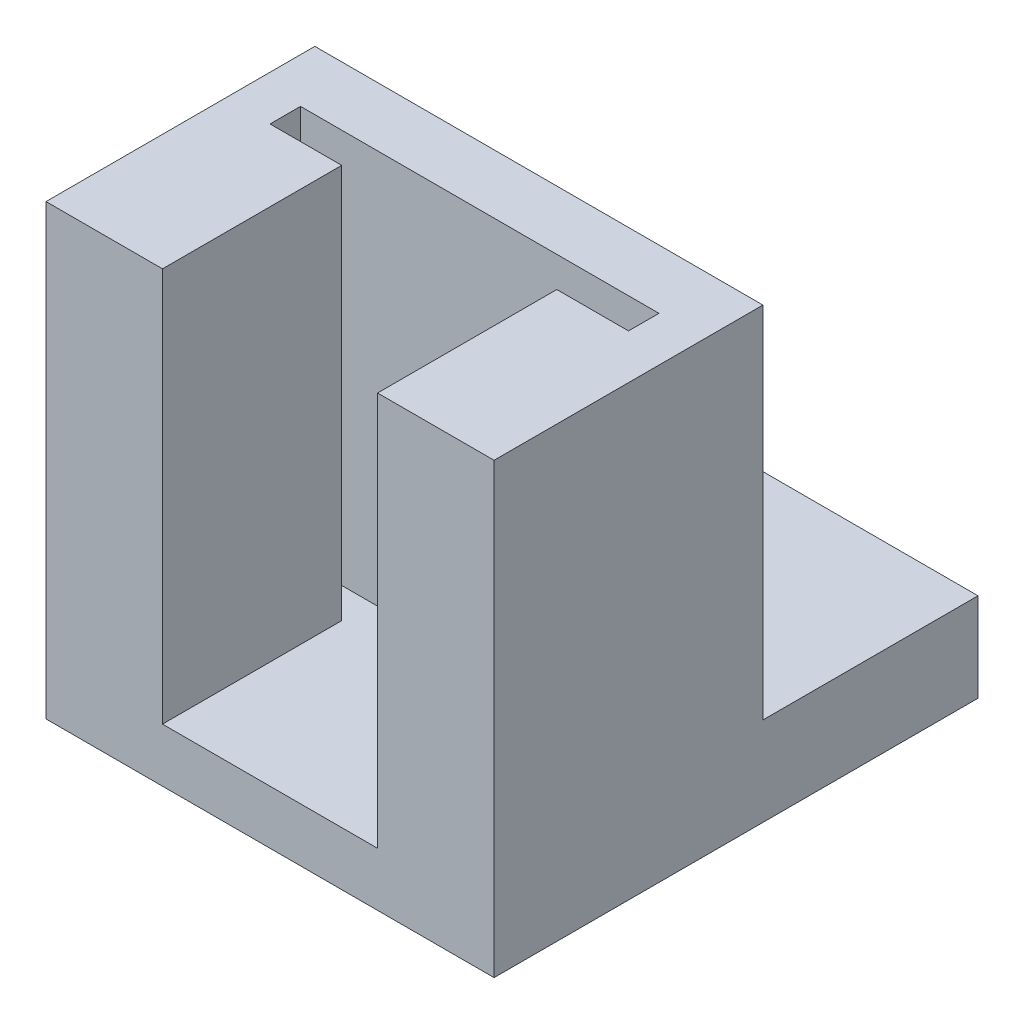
from build123d import *

# Parameters (mm, degrees)
SKETCH1_W           = 25
SKETCH1_H           = 25
BOSS_EXTRUDE1_DEPTH = 15
CUT_EXTRUDE1_DEPTH  = 22
SKETCH3_W           = 25
SKETCH3_H           = 4.951901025
BOSS_EXTRUDE2_DEPTH = 12


with BuildPart() as part:
    # Sketch1 → Boss-Extrude1 (new body)
    with BuildSketch(Plane.XY):
        Rectangle(SKETCH1_W, SKETCH1_H)
    extrude(amount=BOSS_EXTRUDE1_DEPTH)

    # Sketch2 → Cut-Extrude1 (cut)
    with BuildSketch(Plane(origin=(0, 12.5, 0), x_dir=(1, 0, 0), z_dir=(0, 1, 0))):
        Polygon((6, -15), (-6, -15), (-6, -5), (-10, -5), (-10, -3.3), (10, -3.3), (10, -5), (6, -5), align=None)
    extrude(amount=-CUT_EXTRUDE1_DEPTH, mode=Mode.SUBTRACT)

    # Sketch3 → Boss-Extrude2 (add)
    with BuildSketch(Plane(origin=(0, 0, 0), x_dir=(-1, 0, 0), z_dir=(0, 0, -1))):
        with Locations((0, -10.024049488)):
            Rectangle(SKETCH3_W, SKETCH3_H)
    extrude(amount=BOSS_EXTRUDE2_DEPTH)


solid = part.part
